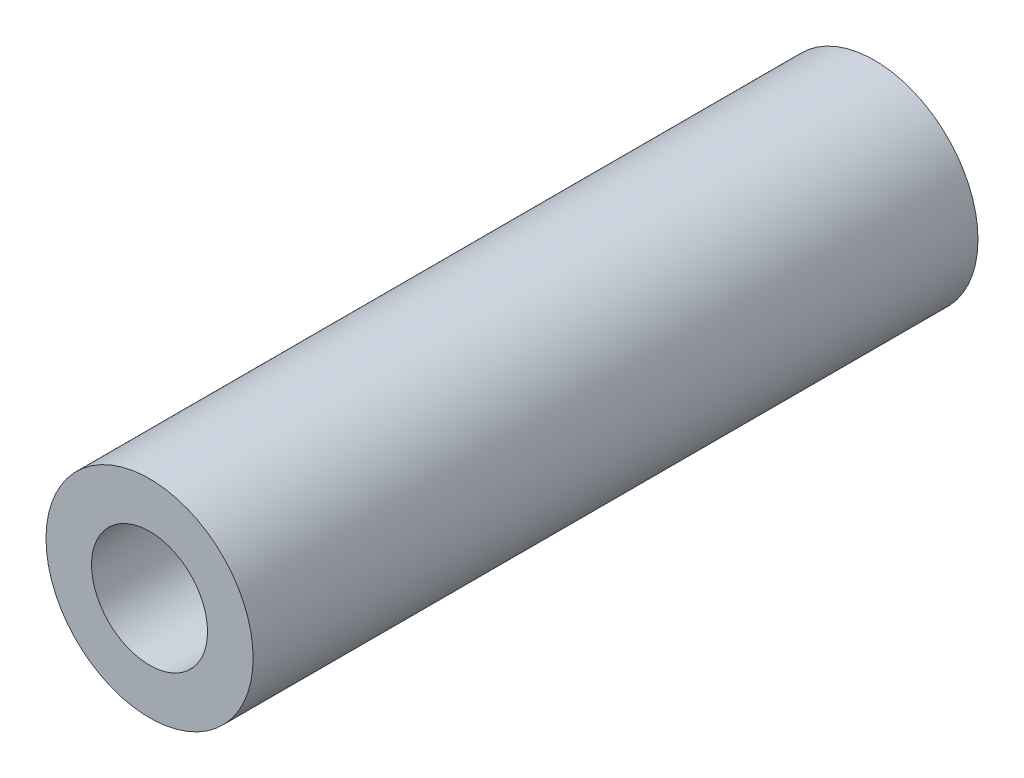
ISO-10303-21;
HEADER;
FILE_DESCRIPTION(('STEP AP214'),'2;1');
FILE_NAME('part.step','',(''),(''),'','','');
FILE_SCHEMA(('AUTOMOTIVE_DESIGN { 1 0 10303 214 1 1 1 1 }'));
ENDSEC;
DATA;
#1=APPLICATION_CONTEXT('core data for automotive mechanical design processes');
#2=APPLICATION_PROTOCOL_DEFINITION('international standard','automotive_design',2000,#1);
#3=PRODUCT_CONTEXT('',#1,'mechanical');
#4=PRODUCT('Part','Part','',(#3));
#5=PRODUCT_RELATED_PRODUCT_CATEGORY('part','',(#4));
#6=PRODUCT_DEFINITION_FORMATION('','',#4);
#7=PRODUCT_DEFINITION_CONTEXT('part definition',#1,'design');
#8=PRODUCT_DEFINITION('design','',#6,#7);
#9=PRODUCT_DEFINITION_SHAPE('','',#8);
#10=(LENGTH_UNIT() NAMED_UNIT(*) SI_UNIT(.MILLI.,.METRE.));
#11=(NAMED_UNIT(*) PLANE_ANGLE_UNIT() SI_UNIT($,.RADIAN.));
#12=(NAMED_UNIT(*) SI_UNIT($,.STERADIAN.) SOLID_ANGLE_UNIT());
#13=UNCERTAINTY_MEASURE_WITH_UNIT(LENGTH_MEASURE(1.E-05),#10,'distance_accuracy_value','');
#14=(GEOMETRIC_REPRESENTATION_CONTEXT(3) GLOBAL_UNCERTAINTY_ASSIGNED_CONTEXT((#13)) GLOBAL_UNIT_ASSIGNED_CONTEXT((#10,
#11,#12)) REPRESENTATION_CONTEXT('',''));
#15=CARTESIAN_POINT('',(0.,0.,0.));
#16=DIRECTION('',(0.,0.,1.));
#17=DIRECTION('',(1.,0.,0.));
#18=AXIS2_PLACEMENT_3D('',#15,#16,#17);
#19=CARTESIAN_POINT('',(0.,0.,11.1125));
#20=DIRECTION('',(0.,0.,1.));
#21=DIRECTION('',(1.,0.,0.));
#22=AXIS2_PLACEMENT_3D('',#19,#20,#21);
#23=PLANE('',#22);
#24=CARTESIAN_POINT('',(0.,0.,11.1125));
#25=DIRECTION('',(0.,0.,1.));
#26=DIRECTION('',(1.,0.,0.));
#27=AXIS2_PLACEMENT_3D('',#24,#25,#26);
#28=CIRCLE('',#27,3.175);
#29=CARTESIAN_POINT('',(3.175,0.,11.1125));
#30=VERTEX_POINT('',#29);
#31=EDGE_CURVE('E10',#30,#30,#28,.T.);
#32=ORIENTED_EDGE('',*,*,#31,.T.);
#33=EDGE_LOOP('',(#32));
#34=FACE_BOUND('',#33,.T.);
#35=CARTESIAN_POINT('',(0.,0.,11.1125));
#36=DIRECTION('',(0.,0.,1.));
#37=DIRECTION('',(1.,0.,0.));
#38=AXIS2_PLACEMENT_3D('',#35,#36,#37);
#39=CIRCLE('',#38,1.778);
#40=CARTESIAN_POINT('',(1.778,0.,11.1125));
#41=VERTEX_POINT('',#40);
#42=EDGE_CURVE('E43',#41,#41,#39,.T.);
#43=ORIENTED_EDGE('',*,*,#42,.F.);
#44=EDGE_LOOP('',(#43));
#45=FACE_BOUND('',#44,.T.);
#46=ADVANCED_FACE('F32',(#34,#45),#23,.T.);
#47=CARTESIAN_POINT('',(0.,0.,-11.1125));
#48=DIRECTION('',(0.,0.,1.));
#49=DIRECTION('',(1.,0.,0.));
#50=AXIS2_PLACEMENT_3D('',#47,#48,#49);
#51=PLANE('',#50);
#52=CARTESIAN_POINT('',(0.,0.,-11.1125));
#53=DIRECTION('',(0.,0.,1.));
#54=DIRECTION('',(1.,0.,0.));
#55=AXIS2_PLACEMENT_3D('',#52,#53,#54);
#56=CIRCLE('',#55,3.175);
#57=CARTESIAN_POINT('',(3.175,0.,-11.1125));
#58=VERTEX_POINT('',#57);
#59=EDGE_CURVE('E36',#58,#58,#56,.T.);
#60=ORIENTED_EDGE('',*,*,#59,.F.);
#61=EDGE_LOOP('',(#60));
#62=FACE_BOUND('',#61,.T.);
#63=CARTESIAN_POINT('',(0.,0.,-11.1125));
#64=DIRECTION('',(0.,0.,1.));
#65=DIRECTION('',(1.,0.,0.));
#66=AXIS2_PLACEMENT_3D('',#63,#64,#65);
#67=CIRCLE('',#66,1.778);
#68=CARTESIAN_POINT('',(1.778,0.,-11.1125));
#69=VERTEX_POINT('',#68);
#70=EDGE_CURVE('E45',#69,#69,#67,.T.);
#71=ORIENTED_EDGE('',*,*,#70,.T.);
#72=EDGE_LOOP('',(#71));
#73=FACE_BOUND('',#72,.T.);
#74=ADVANCED_FACE('F55',(#62,#73),#51,.F.);
#75=CARTESIAN_POINT('',(0.,0.,11.1125));
#76=DIRECTION('',(0.,0.,-1.));
#77=DIRECTION('',(-1.,0.,0.));
#78=AXIS2_PLACEMENT_3D('',#75,#76,#77);
#79=CYLINDRICAL_SURFACE('',#78,3.175);
#80=ORIENTED_EDGE('',*,*,#31,.F.);
#81=EDGE_LOOP('',(#80));
#82=FACE_BOUND('',#81,.T.);
#83=ORIENTED_EDGE('',*,*,#59,.T.);
#84=EDGE_LOOP('',(#83));
#85=FACE_BOUND('',#84,.T.);
#86=ADVANCED_FACE('F34',(#82,#85),#79,.T.);
#87=CARTESIAN_POINT('',(0.,0.,11.1125));
#88=DIRECTION('',(0.,0.,-1.));
#89=DIRECTION('',(-1.,0.,0.));
#90=AXIS2_PLACEMENT_3D('',#87,#88,#89);
#91=CYLINDRICAL_SURFACE('',#90,1.778);
#92=ORIENTED_EDGE('',*,*,#42,.T.);
#93=EDGE_LOOP('',(#92));
#94=FACE_BOUND('',#93,.T.);
#95=ORIENTED_EDGE('',*,*,#70,.F.);
#96=EDGE_LOOP('',(#95));
#97=FACE_BOUND('',#96,.T.);
#98=ADVANCED_FACE('F51',(#94,#97),#91,.F.);
#99=CLOSED_SHELL('',(#46,#74,#86,#98));
#100=MANIFOLD_SOLID_BREP('B2',#99);
#101=ADVANCED_BREP_SHAPE_REPRESENTATION('',(#18,#100),#14);
#102=SHAPE_DEFINITION_REPRESENTATION(#9,#101);
ENDSEC;
END-ISO-10303-21;
